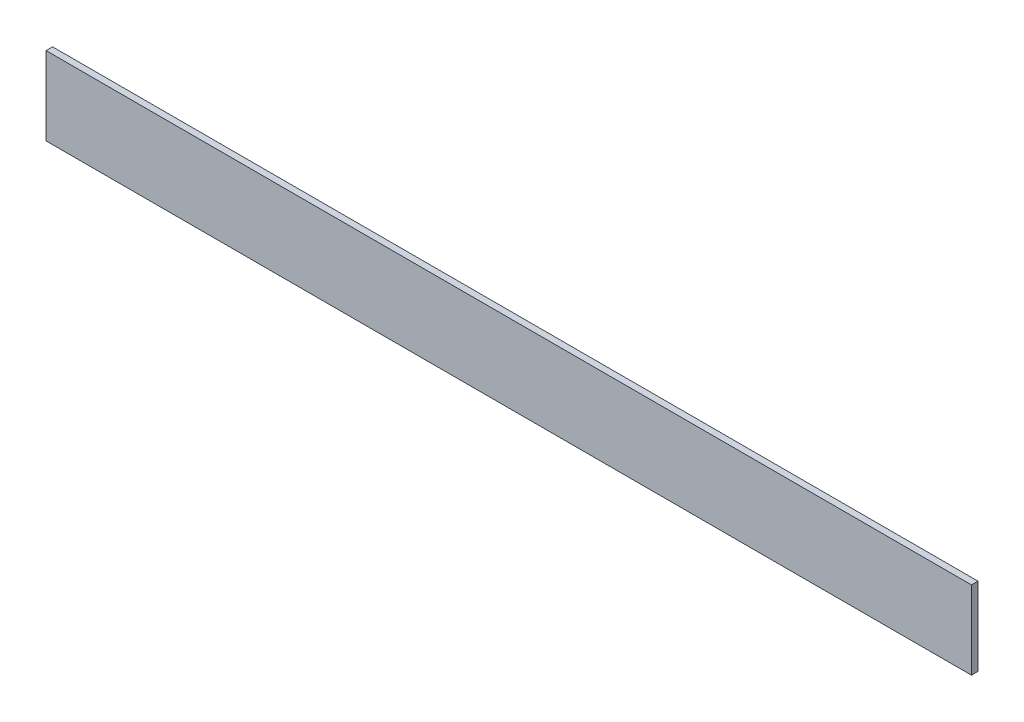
from build123d import *

# Parameters (mm, degrees)
SKETCH1_W           = 901.7
SKETCH1_H           = 76.2
BOSS_EXTRUDE1_DEPTH = 6.35


with BuildPart() as part:
    # Sketch1 → Boss-Extrude1 (new body)
    with BuildSketch(Plane.XY):
        Rectangle(SKETCH1_W, SKETCH1_H)
    extrude(amount=BOSS_EXTRUDE1_DEPTH)


solid = part.part
